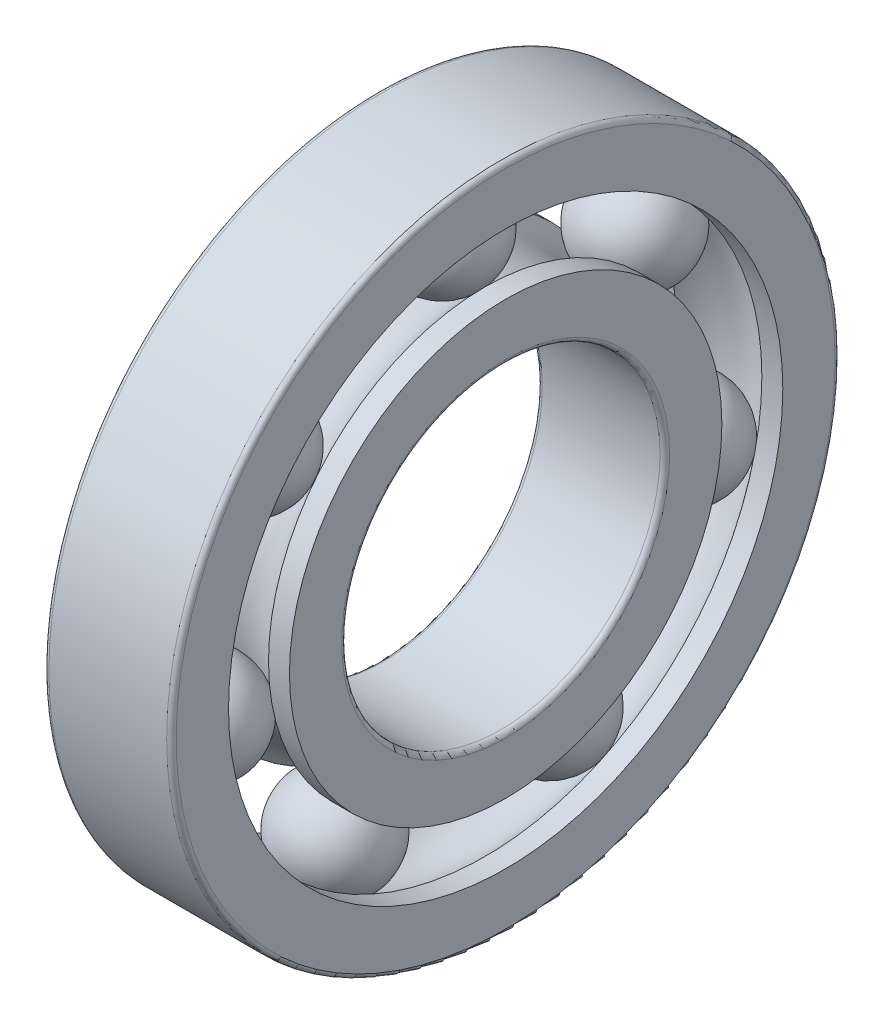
ISO-10303-21;
HEADER;
FILE_DESCRIPTION(('STEP AP214'),'2;1');
FILE_NAME('part.step','',(''),(''),'','','');
FILE_SCHEMA(('AUTOMOTIVE_DESIGN { 1 0 10303 214 1 1 1 1 }'));
ENDSEC;
DATA;
#1=APPLICATION_CONTEXT('core data for automotive mechanical design processes');
#2=APPLICATION_PROTOCOL_DEFINITION('international standard','automotive_design',2000,#1);
#3=PRODUCT_CONTEXT('',#1,'mechanical');
#4=PRODUCT('Part','Part','',(#3));
#5=PRODUCT_RELATED_PRODUCT_CATEGORY('part','',(#4));
#6=PRODUCT_DEFINITION_FORMATION('','',#4);
#7=PRODUCT_DEFINITION_CONTEXT('part definition',#1,'design');
#8=PRODUCT_DEFINITION('design','',#6,#7);
#9=PRODUCT_DEFINITION_SHAPE('','',#8);
#10=(LENGTH_UNIT() NAMED_UNIT(*) SI_UNIT(.MILLI.,.METRE.));
#11=(NAMED_UNIT(*) PLANE_ANGLE_UNIT() SI_UNIT($,.RADIAN.));
#12=(NAMED_UNIT(*) SI_UNIT($,.STERADIAN.) SOLID_ANGLE_UNIT());
#13=UNCERTAINTY_MEASURE_WITH_UNIT(LENGTH_MEASURE(1.E-05),#10,'distance_accuracy_value','');
#14=(GEOMETRIC_REPRESENTATION_CONTEXT(3) GLOBAL_UNCERTAINTY_ASSIGNED_CONTEXT((#13)) GLOBAL_UNIT_ASSIGNED_CONTEXT((#10,
#11,#12)) REPRESENTATION_CONTEXT('',''));
#15=CARTESIAN_POINT('',(0.,0.,0.));
#16=DIRECTION('',(0.,0.,1.));
#17=DIRECTION('',(1.,0.,0.));
#18=AXIS2_PLACEMENT_3D('',#15,#16,#17);
#19=CARTESIAN_POINT('',(4.00000000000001,0.,0.));
#20=DIRECTION('',(1.,0.,0.));
#21=DIRECTION('',(0.,0.,-1.));
#22=AXIS2_PLACEMENT_3D('',#19,#20,#21);
#23=TOROIDAL_SURFACE('',#22,15.5,3.2967);
#24=CARTESIAN_POINT('',(6.68418235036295,0.,0.));
#25=DIRECTION('',(1.,0.,0.));
#26=DIRECTION('',(0.,0.,-1.));
#27=AXIS2_PLACEMENT_3D('',#24,#25,#26);
#28=CIRCLE('',#27,13.586);
#29=CARTESIAN_POINT('',(6.68418235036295,0.,-13.586));
#30=VERTEX_POINT('',#29);
#31=EDGE_CURVE('P0_E110',#30,#30,#28,.T.);
#32=ORIENTED_EDGE('',*,*,#31,.F.);
#33=EDGE_LOOP('',(#32));
#34=FACE_BOUND('',#33,.T.);
#35=CARTESIAN_POINT('',(1.31581764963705,0.,0.));
#36=DIRECTION('',(1.,0.,0.));
#37=DIRECTION('',(0.,0.,-1.));
#38=AXIS2_PLACEMENT_3D('',#35,#36,#37);
#39=CIRCLE('',#38,13.586);
#40=CARTESIAN_POINT('',(1.31581764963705,0.,-13.586));
#41=VERTEX_POINT('',#40);
#42=EDGE_CURVE('P0_E108',#41,#41,#39,.F.);
#43=ORIENTED_EDGE('',*,*,#42,.F.);
#44=EDGE_LOOP('',(#43));
#45=FACE_BOUND('',#44,.T.);
#46=ADVANCED_FACE('P0_F14',(#34,#45),#23,.F.);
#47=CARTESIAN_POINT('',(7.34209117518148,0.,0.));
#48=DIRECTION('',(1.,0.,0.));
#49=DIRECTION('',(0.,0.,-1.));
#50=AXIS2_PLACEMENT_3D('',#47,#48,#49);
#51=CYLINDRICAL_SURFACE('',#50,13.586);
#52=ORIENTED_EDGE('',*,*,#31,.T.);
#53=EDGE_LOOP('',(#52));
#54=FACE_BOUND('',#53,.T.);
#55=CARTESIAN_POINT('',(8.,0.,0.));
#56=DIRECTION('',(1.,0.,0.));
#57=DIRECTION('',(0.,0.,-1.));
#58=AXIS2_PLACEMENT_3D('',#55,#56,#57);
#59=CIRCLE('',#58,13.586);
#60=CARTESIAN_POINT('',(8.,0.,-13.586));
#61=VERTEX_POINT('',#60);
#62=EDGE_CURVE('P0_E17',#61,#61,#59,.T.);
#63=ORIENTED_EDGE('',*,*,#62,.F.);
#64=EDGE_LOOP('',(#63));
#65=FACE_BOUND('',#64,.T.);
#66=ADVANCED_FACE('P0_F83',(#54,#65),#51,.T.);
#67=CARTESIAN_POINT('',(0.657908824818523,0.,0.));
#68=DIRECTION('',(1.,0.,0.));
#69=DIRECTION('',(0.,0.,-1.));
#70=AXIS2_PLACEMENT_3D('',#67,#68,#69);
#71=CYLINDRICAL_SURFACE('',#70,13.586);
#72=CARTESIAN_POINT('',(0.,0.,0.));
#73=DIRECTION('',(1.,0.,0.));
#74=DIRECTION('',(0.,0.,-1.));
#75=AXIS2_PLACEMENT_3D('',#72,#73,#74);
#76=CIRCLE('',#75,13.586);
#77=CARTESIAN_POINT('',(0.,0.,-13.586));
#78=VERTEX_POINT('',#77);
#79=EDGE_CURVE('P0_E103',#78,#78,#76,.F.);
#80=ORIENTED_EDGE('',*,*,#79,.F.);
#81=EDGE_LOOP('',(#80));
#82=FACE_BOUND('',#81,.T.);
#83=ORIENTED_EDGE('',*,*,#42,.T.);
#84=EDGE_LOOP('',(#83));
#85=FACE_BOUND('',#84,.T.);
#86=ADVANCED_FACE('P0_F80',(#82,#85),#71,.T.);
#87=CARTESIAN_POINT('',(8.,11.793,0.));
#88=DIRECTION('',(1.,0.,0.));
#89=DIRECTION('',(0.,0.,-1.));
#90=AXIS2_PLACEMENT_3D('',#87,#88,#89);
#91=PLANE('',#90);
#92=CARTESIAN_POINT('',(8.,0.,0.));
#93=DIRECTION('',(1.,0.,0.));
#94=DIRECTION('',(0.,1.,0.));
#95=AXIS2_PLACEMENT_3D('',#92,#93,#94);
#96=CIRCLE('',#95,10.3);
#97=CARTESIAN_POINT('',(8.,10.3,0.));
#98=VERTEX_POINT('',#97);
#99=EDGE_CURVE('P0_E64',#98,#98,#96,.T.);
#100=ORIENTED_EDGE('',*,*,#99,.F.);
#101=EDGE_LOOP('',(#100));
#102=FACE_BOUND('',#101,.T.);
#103=ORIENTED_EDGE('',*,*,#62,.T.);
#104=EDGE_LOOP('',(#103));
#105=FACE_BOUND('',#104,.T.);
#106=ADVANCED_FACE('P0_F70',(#102,#105),#91,.T.);
#107=CARTESIAN_POINT('',(0.,11.793,0.));
#108=DIRECTION('',(-1.,0.,0.));
#109=DIRECTION('',(0.,0.,1.));
#110=AXIS2_PLACEMENT_3D('',#107,#108,#109);
#111=PLANE('',#110);
#112=CARTESIAN_POINT('',(0.,0.,0.));
#113=DIRECTION('',(-1.,0.,0.));
#114=DIRECTION('',(0.,1.,0.));
#115=AXIS2_PLACEMENT_3D('',#112,#113,#114);
#116=CIRCLE('',#115,10.3);
#117=CARTESIAN_POINT('',(0.,10.3,0.));
#118=VERTEX_POINT('',#117);
#119=EDGE_CURVE('P0_E26',#118,#118,#116,.T.);
#120=ORIENTED_EDGE('',*,*,#119,.F.);
#121=EDGE_LOOP('',(#120));
#122=FACE_BOUND('',#121,.T.);
#123=ORIENTED_EDGE('',*,*,#79,.T.);
#124=EDGE_LOOP('',(#123));
#125=FACE_BOUND('',#124,.T.);
#126=ADVANCED_FACE('P0_F79',(#122,#125),#111,.T.);
#127=CARTESIAN_POINT('',(7.7,0.,0.));
#128=DIRECTION('',(1.,0.,0.));
#129=DIRECTION('',(0.,0.,-1.));
#130=AXIS2_PLACEMENT_3D('',#127,#128,#129);
#131=TOROIDAL_SURFACE('',#130,10.3,0.3);
#132=CARTESIAN_POINT('',(7.7,0.,0.));
#133=DIRECTION('',(1.,0.,0.));
#134=DIRECTION('',(0.,0.,-1.));
#135=AXIS2_PLACEMENT_3D('',#132,#133,#134);
#136=CIRCLE('',#135,10.);
#137=CARTESIAN_POINT('',(7.7,0.,-10.));
#138=VERTEX_POINT('',#137);
#139=EDGE_CURVE('P0_E21',#138,#138,#136,.F.);
#140=ORIENTED_EDGE('',*,*,#139,.T.);
#141=EDGE_LOOP('',(#140));
#142=FACE_BOUND('',#141,.T.);
#143=ORIENTED_EDGE('',*,*,#99,.T.);
#144=EDGE_LOOP('',(#143));
#145=FACE_BOUND('',#144,.T.);
#146=ADVANCED_FACE('P0_F44',(#142,#145),#131,.T.);
#147=CARTESIAN_POINT('',(0.300000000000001,0.,0.));
#148=DIRECTION('',(1.,0.,0.));
#149=DIRECTION('',(0.,0.,-1.));
#150=AXIS2_PLACEMENT_3D('',#147,#148,#149);
#151=TOROIDAL_SURFACE('',#150,10.3,0.3);
#152=ORIENTED_EDGE('',*,*,#119,.T.);
#153=EDGE_LOOP('',(#152));
#154=FACE_BOUND('',#153,.T.);
#155=CARTESIAN_POINT('',(0.300000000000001,0.,0.));
#156=DIRECTION('',(1.,0.,0.));
#157=DIRECTION('',(0.,0.,-1.));
#158=AXIS2_PLACEMENT_3D('',#155,#156,#157);
#159=CIRCLE('',#158,10.);
#160=CARTESIAN_POINT('',(0.300000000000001,0.,-10.));
#161=VERTEX_POINT('',#160);
#162=EDGE_CURVE('P0_E10',#161,#161,#159,.T.);
#163=ORIENTED_EDGE('',*,*,#162,.T.);
#164=EDGE_LOOP('',(#163));
#165=FACE_BOUND('',#164,.T.);
#166=ADVANCED_FACE('P0_F38',(#154,#165),#151,.T.);
#167=CARTESIAN_POINT('',(4.,0.,0.));
#168=DIRECTION('',(1.,0.,0.));
#169=DIRECTION('',(0.,0.,-1.));
#170=AXIS2_PLACEMENT_3D('',#167,#168,#169);
#171=CYLINDRICAL_SURFACE('',#170,10.);
#172=ORIENTED_EDGE('',*,*,#162,.F.);
#173=EDGE_LOOP('',(#172));
#174=FACE_BOUND('',#173,.T.);
#175=ORIENTED_EDGE('',*,*,#139,.F.);
#176=EDGE_LOOP('',(#175));
#177=FACE_BOUND('',#176,.T.);
#178=ADVANCED_FACE('P0_F43',(#174,#177),#171,.F.);
#179=CLOSED_SHELL('',(#46,#66,#86,#106,#126,#146,#166,#178));
#180=MANIFOLD_SOLID_BREP('P0_B1',#179);
#181=CARTESIAN_POINT('',(4.,0.,0.));
#182=DIRECTION('',(1.,0.,0.));
#183=DIRECTION('',(0.,0.,-1.));
#184=AXIS2_PLACEMENT_3D('',#181,#182,#183);
#185=TOROIDAL_SURFACE('',#184,15.5,3.29669999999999);
#186=CARTESIAN_POINT('',(6.68418235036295,0.,0.));
#187=DIRECTION('',(1.,0.,0.));
#188=DIRECTION('',(0.,0.,-1.));
#189=AXIS2_PLACEMENT_3D('',#186,#187,#188);
#190=CIRCLE('',#189,17.414);
#191=CARTESIAN_POINT('',(6.68418235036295,0.,-17.414));
#192=VERTEX_POINT('',#191);
#193=EDGE_CURVE('P1_E108',#192,#192,#190,.T.);
#194=ORIENTED_EDGE('',*,*,#193,.T.);
#195=EDGE_LOOP('',(#194));
#196=FACE_BOUND('',#195,.T.);
#197=CARTESIAN_POINT('',(1.31581764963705,0.,0.));
#198=DIRECTION('',(1.,0.,0.));
#199=DIRECTION('',(0.,0.,-1.));
#200=AXIS2_PLACEMENT_3D('',#197,#198,#199);
#201=CIRCLE('',#200,17.414);
#202=CARTESIAN_POINT('',(1.31581764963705,0.,-17.414));
#203=VERTEX_POINT('',#202);
#204=EDGE_CURVE('P1_E110',#203,#203,#201,.F.);
#205=ORIENTED_EDGE('',*,*,#204,.T.);
#206=EDGE_LOOP('',(#205));
#207=FACE_BOUND('',#206,.T.);
#208=ADVANCED_FACE('P1_F14',(#196,#207),#185,.F.);
#209=CARTESIAN_POINT('',(0.657908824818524,0.,0.));
#210=DIRECTION('',(1.,0.,0.));
#211=DIRECTION('',(0.,0.,-1.));
#212=AXIS2_PLACEMENT_3D('',#209,#210,#211);
#213=CYLINDRICAL_SURFACE('',#212,17.414);
#214=ORIENTED_EDGE('',*,*,#204,.F.);
#215=EDGE_LOOP('',(#214));
#216=FACE_BOUND('',#215,.T.);
#217=CARTESIAN_POINT('',(0.,0.,0.));
#218=DIRECTION('',(1.,0.,0.));
#219=DIRECTION('',(0.,0.,-1.));
#220=AXIS2_PLACEMENT_3D('',#217,#218,#219);
#221=CIRCLE('',#220,17.414);
#222=CARTESIAN_POINT('',(0.,0.,-17.414));
#223=VERTEX_POINT('',#222);
#224=EDGE_CURVE('P1_E17',#223,#223,#221,.T.);
#225=ORIENTED_EDGE('',*,*,#224,.F.);
#226=EDGE_LOOP('',(#225));
#227=FACE_BOUND('',#226,.T.);
#228=ADVANCED_FACE('P1_F84',(#216,#227),#213,.F.);
#229=CARTESIAN_POINT('',(7.34209117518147,0.,0.));
#230=DIRECTION('',(1.,0.,0.));
#231=DIRECTION('',(0.,0.,-1.));
#232=AXIS2_PLACEMENT_3D('',#229,#230,#231);
#233=CYLINDRICAL_SURFACE('',#232,17.414);
#234=CARTESIAN_POINT('',(8.,0.,0.));
#235=DIRECTION('',(1.,0.,0.));
#236=DIRECTION('',(0.,0.,-1.));
#237=AXIS2_PLACEMENT_3D('',#234,#235,#236);
#238=CIRCLE('',#237,17.414);
#239=CARTESIAN_POINT('',(8.,0.,-17.414));
#240=VERTEX_POINT('',#239);
#241=EDGE_CURVE('P1_E103',#240,#240,#238,.F.);
#242=ORIENTED_EDGE('',*,*,#241,.F.);
#243=EDGE_LOOP('',(#242));
#244=FACE_BOUND('',#243,.T.);
#245=ORIENTED_EDGE('',*,*,#193,.F.);
#246=EDGE_LOOP('',(#245));
#247=FACE_BOUND('',#246,.T.);
#248=ADVANCED_FACE('P1_F80',(#244,#247),#233,.F.);
#249=CARTESIAN_POINT('',(0.,19.207,0.));
#250=DIRECTION('',(-1.,0.,0.));
#251=DIRECTION('',(0.,0.,1.));
#252=AXIS2_PLACEMENT_3D('',#249,#250,#251);
#253=PLANE('',#252);
#254=ORIENTED_EDGE('',*,*,#224,.T.);
#255=EDGE_LOOP('',(#254));
#256=FACE_BOUND('',#255,.T.);
#257=CARTESIAN_POINT('',(0.,0.,0.));
#258=DIRECTION('',(1.,0.,0.));
#259=DIRECTION('',(0.,1.,0.));
#260=AXIS2_PLACEMENT_3D('',#257,#258,#259);
#261=CIRCLE('',#260,20.7);
#262=CARTESIAN_POINT('',(0.,20.7,0.));
#263=VERTEX_POINT('',#262);
#264=EDGE_CURVE('P1_E64',#263,#263,#261,.T.);
#265=ORIENTED_EDGE('',*,*,#264,.F.);
#266=EDGE_LOOP('',(#265));
#267=FACE_BOUND('',#266,.T.);
#268=ADVANCED_FACE('P1_F70',(#256,#267),#253,.T.);
#269=CARTESIAN_POINT('',(8.,19.207,0.));
#270=DIRECTION('',(1.,0.,0.));
#271=DIRECTION('',(0.,0.,-1.));
#272=AXIS2_PLACEMENT_3D('',#269,#270,#271);
#273=PLANE('',#272);
#274=ORIENTED_EDGE('',*,*,#241,.T.);
#275=EDGE_LOOP('',(#274));
#276=FACE_BOUND('',#275,.T.);
#277=CARTESIAN_POINT('',(8.,0.,0.));
#278=DIRECTION('',(-1.,0.,0.));
#279=DIRECTION('',(0.,1.,0.));
#280=AXIS2_PLACEMENT_3D('',#277,#278,#279);
#281=CIRCLE('',#280,20.7);
#282=CARTESIAN_POINT('',(8.,20.7,0.));
#283=VERTEX_POINT('',#282);
#284=EDGE_CURVE('P1_E26',#283,#283,#281,.T.);
#285=ORIENTED_EDGE('',*,*,#284,.F.);
#286=EDGE_LOOP('',(#285));
#287=FACE_BOUND('',#286,.T.);
#288=ADVANCED_FACE('P1_F79',(#276,#287),#273,.T.);
#289=CARTESIAN_POINT('',(0.299999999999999,0.,0.));
#290=DIRECTION('',(1.,0.,0.));
#291=DIRECTION('',(0.,0.,-1.));
#292=AXIS2_PLACEMENT_3D('',#289,#290,#291);
#293=TOROIDAL_SURFACE('',#292,20.7,0.3);
#294=CARTESIAN_POINT('',(0.299999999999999,0.,0.));
#295=DIRECTION('',(1.,0.,0.));
#296=DIRECTION('',(0.,0.,-1.));
#297=AXIS2_PLACEMENT_3D('',#294,#295,#296);
#298=CIRCLE('',#297,21.);
#299=CARTESIAN_POINT('',(0.299999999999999,0.,-21.));
#300=VERTEX_POINT('',#299);
#301=EDGE_CURVE('P1_E21',#300,#300,#298,.T.);
#302=ORIENTED_EDGE('',*,*,#301,.F.);
#303=EDGE_LOOP('',(#302));
#304=FACE_BOUND('',#303,.T.);
#305=ORIENTED_EDGE('',*,*,#264,.T.);
#306=EDGE_LOOP('',(#305));
#307=FACE_BOUND('',#306,.T.);
#308=ADVANCED_FACE('P1_F44',(#304,#307),#293,.T.);
#309=CARTESIAN_POINT('',(7.7,0.,0.));
#310=DIRECTION('',(1.,0.,0.));
#311=DIRECTION('',(0.,0.,-1.));
#312=AXIS2_PLACEMENT_3D('',#309,#310,#311);
#313=TOROIDAL_SURFACE('',#312,20.7,0.3);
#314=ORIENTED_EDGE('',*,*,#284,.T.);
#315=EDGE_LOOP('',(#314));
#316=FACE_BOUND('',#315,.T.);
#317=CARTESIAN_POINT('',(7.7,0.,0.));
#318=DIRECTION('',(1.,0.,0.));
#319=DIRECTION('',(0.,0.,-1.));
#320=AXIS2_PLACEMENT_3D('',#317,#318,#319);
#321=CIRCLE('',#320,21.);
#322=CARTESIAN_POINT('',(7.7,0.,-21.));
#323=VERTEX_POINT('',#322);
#324=EDGE_CURVE('P1_E10',#323,#323,#321,.F.);
#325=ORIENTED_EDGE('',*,*,#324,.F.);
#326=EDGE_LOOP('',(#325));
#327=FACE_BOUND('',#326,.T.);
#328=ADVANCED_FACE('P1_F38',(#316,#327),#313,.T.);
#329=CARTESIAN_POINT('',(4.,0.,0.));
#330=DIRECTION('',(1.,0.,0.));
#331=DIRECTION('',(0.,0.,-1.));
#332=AXIS2_PLACEMENT_3D('',#329,#330,#331);
#333=CYLINDRICAL_SURFACE('',#332,21.);
#334=ORIENTED_EDGE('',*,*,#324,.T.);
#335=EDGE_LOOP('',(#334));
#336=FACE_BOUND('',#335,.T.);
#337=ORIENTED_EDGE('',*,*,#301,.T.);
#338=EDGE_LOOP('',(#337));
#339=FACE_BOUND('',#338,.T.);
#340=ADVANCED_FACE('P1_F43',(#336,#339),#333,.T.);
#341=CLOSED_SHELL('',(#208,#228,#248,#268,#288,#308,#328,#340));
#342=MANIFOLD_SOLID_BREP('P1_B1',#341);
#343=CARTESIAN_POINT('',(4.,9.66409192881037,-12.1183879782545));
#344=DIRECTION('',(1.,0.,0.));
#345=DIRECTION('',(0.,0.623489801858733,-0.78183148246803));
#346=AXIS2_PLACEMENT_3D('',#343,#344,#345);
#347=SPHERICAL_SURFACE('',#346,3.2967);
#348=CARTESIAN_POINT('',(0.703300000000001,9.66409192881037,-12.1183879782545));
#349=VERTEX_POINT('',#348);
#350=VERTEX_LOOP('',#349);
#351=FACE_BOUND('',#350,.T.);
#352=CARTESIAN_POINT('',(7.2967,9.66409192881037,-12.1183879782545));
#353=VERTEX_POINT('',#352);
#354=VERTEX_LOOP('',#353);
#355=FACE_BOUND('',#354,.T.);
#356=ADVANCED_FACE('P2_F15',(#351,#355),#347,.T.);
#357=CLOSED_SHELL('',(#356));
#358=MANIFOLD_SOLID_BREP('P2_B1',#357);
#359=CARTESIAN_POINT('',(4.,-3.44907447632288,-15.1113826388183));
#360=DIRECTION('',(1.,0.,0.));
#361=DIRECTION('',(0.,-0.222520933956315,-0.974927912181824));
#362=AXIS2_PLACEMENT_3D('',#359,#360,#361);
#363=SPHERICAL_SURFACE('',#362,3.2967);
#364=CARTESIAN_POINT('',(0.703300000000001,-3.44907447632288,-15.1113826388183));
#365=VERTEX_POINT('',#364);
#366=VERTEX_LOOP('',#365);
#367=FACE_BOUND('',#366,.T.);
#368=CARTESIAN_POINT('',(7.2967,-3.44907447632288,-15.1113826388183));
#369=VERTEX_POINT('',#368);
#370=VERTEX_LOOP('',#369);
#371=FACE_BOUND('',#370,.T.);
#372=ADVANCED_FACE('P3_F15',(#367,#371),#363,.T.);
#373=CLOSED_SHELL('',(#372));
#374=MANIFOLD_SOLID_BREP('P3_B1',#373);
#375=CARTESIAN_POINT('',(4.,15.5,0.));
#376=DIRECTION('',(1.,0.,0.));
#377=DIRECTION('',(0.,1.,0.));
#378=AXIS2_PLACEMENT_3D('',#375,#376,#377);
#379=SPHERICAL_SURFACE('',#378,3.2967);
#380=CARTESIAN_POINT('',(0.703300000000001,15.5,0.));
#381=VERTEX_POINT('',#380);
#382=VERTEX_LOOP('',#381);
#383=FACE_BOUND('',#382,.T.);
#384=CARTESIAN_POINT('',(7.2967,15.5,0.));
#385=VERTEX_POINT('',#384);
#386=VERTEX_LOOP('',#385);
#387=FACE_BOUND('',#386,.T.);
#388=ADVANCED_FACE('P4_F15',(#383,#387),#379,.T.);
#389=CLOSED_SHELL('',(#388));
#390=MANIFOLD_SOLID_BREP('P4_B1',#389);
#391=CARTESIAN_POINT('',(4.,-13.9650174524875,-6.72519795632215));
#392=DIRECTION('',(1.,0.,0.));
#393=DIRECTION('',(0.,-0.900968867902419,-0.433883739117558));
#394=AXIS2_PLACEMENT_3D('',#391,#392,#393);
#395=SPHERICAL_SURFACE('',#394,3.2967);
#396=CARTESIAN_POINT('',(0.703300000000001,-13.9650174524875,-6.72519795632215));
#397=VERTEX_POINT('',#396);
#398=VERTEX_LOOP('',#397);
#399=FACE_BOUND('',#398,.T.);
#400=CARTESIAN_POINT('',(7.2967,-13.9650174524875,-6.72519795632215));
#401=VERTEX_POINT('',#400);
#402=VERTEX_LOOP('',#401);
#403=FACE_BOUND('',#402,.T.);
#404=ADVANCED_FACE('P5_F15',(#399,#403),#395,.T.);
#405=CLOSED_SHELL('',(#404));
#406=MANIFOLD_SOLID_BREP('P5_B1',#405);
#407=CARTESIAN_POINT('',(4.,-13.9650174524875,6.72519795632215));
#408=DIRECTION('',(1.,0.,0.));
#409=DIRECTION('',(0.,-0.900968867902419,0.433883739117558));
#410=AXIS2_PLACEMENT_3D('',#407,#408,#409);
#411=SPHERICAL_SURFACE('',#410,3.2967);
#412=CARTESIAN_POINT('',(0.703300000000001,-13.9650174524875,6.72519795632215));
#413=VERTEX_POINT('',#412);
#414=VERTEX_LOOP('',#413);
#415=FACE_BOUND('',#414,.T.);
#416=CARTESIAN_POINT('',(7.2967,-13.9650174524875,6.72519795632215));
#417=VERTEX_POINT('',#416);
#418=VERTEX_LOOP('',#417);
#419=FACE_BOUND('',#418,.T.);
#420=ADVANCED_FACE('P6_F15',(#415,#419),#411,.T.);
#421=CLOSED_SHELL('',(#420));
#422=MANIFOLD_SOLID_BREP('P6_B1',#421);
#423=CARTESIAN_POINT('',(4.,-3.44907447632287,15.1113826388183));
#424=DIRECTION('',(1.,0.,0.));
#425=DIRECTION('',(0.,-0.222520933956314,0.974927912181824));
#426=AXIS2_PLACEMENT_3D('',#423,#424,#425);
#427=SPHERICAL_SURFACE('',#426,3.2967);
#428=CARTESIAN_POINT('',(0.703300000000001,-3.44907447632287,15.1113826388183));
#429=VERTEX_POINT('',#428);
#430=VERTEX_LOOP('',#429);
#431=FACE_BOUND('',#430,.T.);
#432=CARTESIAN_POINT('',(7.2967,-3.44907447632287,15.1113826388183));
#433=VERTEX_POINT('',#432);
#434=VERTEX_LOOP('',#433);
#435=FACE_BOUND('',#434,.T.);
#436=ADVANCED_FACE('P7_F15',(#431,#435),#427,.T.);
#437=CLOSED_SHELL('',(#436));
#438=MANIFOLD_SOLID_BREP('P7_B1',#437);
#439=CARTESIAN_POINT('',(4.,9.66409192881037,12.1183879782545));
#440=DIRECTION('',(1.,0.,0.));
#441=DIRECTION('',(0.,0.623489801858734,0.78183148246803));
#442=AXIS2_PLACEMENT_3D('',#439,#440,#441);
#443=SPHERICAL_SURFACE('',#442,3.2967);
#444=CARTESIAN_POINT('',(0.703300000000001,9.66409192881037,12.1183879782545));
#445=VERTEX_POINT('',#444);
#446=VERTEX_LOOP('',#445);
#447=FACE_BOUND('',#446,.T.);
#448=CARTESIAN_POINT('',(7.2967,9.66409192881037,12.1183879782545));
#449=VERTEX_POINT('',#448);
#450=VERTEX_LOOP('',#449);
#451=FACE_BOUND('',#450,.T.);
#452=ADVANCED_FACE('P8_F15',(#447,#451),#443,.T.);
#453=CLOSED_SHELL('',(#452));
#454=MANIFOLD_SOLID_BREP('P8_B1',#453);
#455=ADVANCED_BREP_SHAPE_REPRESENTATION('',(#18,#180,#342,#358,#374,#390,#406,#422,#438,#454),#14);
#456=SHAPE_DEFINITION_REPRESENTATION(#9,#455);
ENDSEC;
END-ISO-10303-21;
